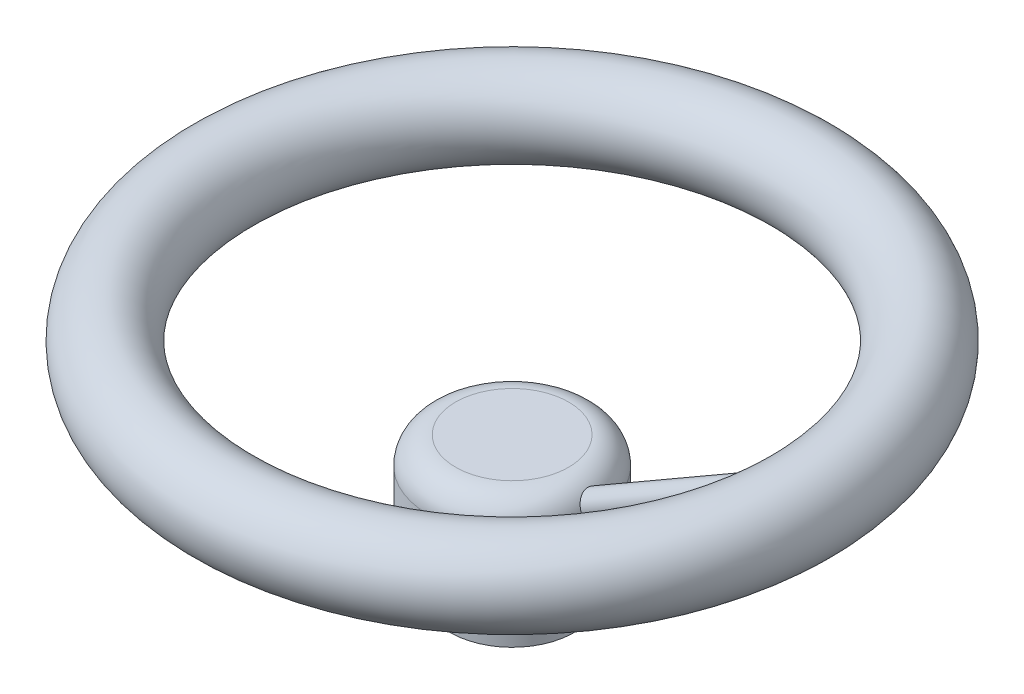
from build123d import *

# Parameters (mm, degrees)
SKETCH1_R                      = 8.734980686
BOSS_EXTRUDE2_REACH            = 104.166
BOSS_EXTRUDE2_END_MAJOR_RADIUS = 60.445848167
BOSS_EXTRUDE2_END_MINOR_RADIUS = 8.734980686
SKETCH2_R                      = 2.687780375


with BuildPart() as part:
    # Sketch1 → Revolve1 (revolve)
    with BuildSketch(Plane.XY, mode=Mode.PRIVATE) as revolve1_sk:
        with Locations((60.445848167, 17.075098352)):
            Circle(SKETCH1_R)
        with BuildLine():
            Line((0, 0), (11.862125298, 0))
            ThreePointArc((11.862125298, 0), (15.908862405, -1.676213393), (17.585075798, -5.7229505))
            Line((17.585075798, -5.7229505), (17.585075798, -12.382969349))
            Line((17.585075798, -12.382969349), (13.062097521, -12.382969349))
            Line((13.062097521, -12.382969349), (13.062097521, -29.427049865))
            Line((13.062097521, -29.427049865), (0, -29.427049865))
            Line((0, -29.427049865), (0, 0))
        make_face()
    revolve(revolve1_sk.sketch.rotate(Axis((0, 0, 0), (0, -1, 0)), 180), axis=Axis((0, 0, 0), (0, -1, 0)))

    # Boss-Extrude2: up to this torus (the profile starts outside it)
    boss_extrude2_end = Plane(origin=(0, 17.075098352, 0), z_dir=(0, 1, 0)) * Torus(BOSS_EXTRUDE2_END_MAJOR_RADIUS, BOSS_EXTRUDE2_END_MINOR_RADIUS, mode=Mode.PRIVATE)
    # Sketch2 → Boss-Extrude2 (add, up to the surface)
    with BuildSketch(Plane(origin=(0, 0, 0), x_dir=(-0.5000000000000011, 0.8660254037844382, 0), z_dir=(0.8660254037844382, 0.5000000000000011, 0)), mode=Mode.PRIVATE) as boss_extrude2_sk1:
        with Locations(Location((-12.054355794, 0, 0), (0, 0, 190.189125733))):
            Circle(SKETCH2_R)
    boss_extrude2_tool1 = extrude(boss_extrude2_sk1.sketch, amount=BOSS_EXTRUDE2_REACH, mode=Mode.PRIVATE) - boss_extrude2_end
    add(boss_extrude2_tool1.solids().sort_by_distance((6.027178, -10.439378, 0))[0])


solid = part.part
